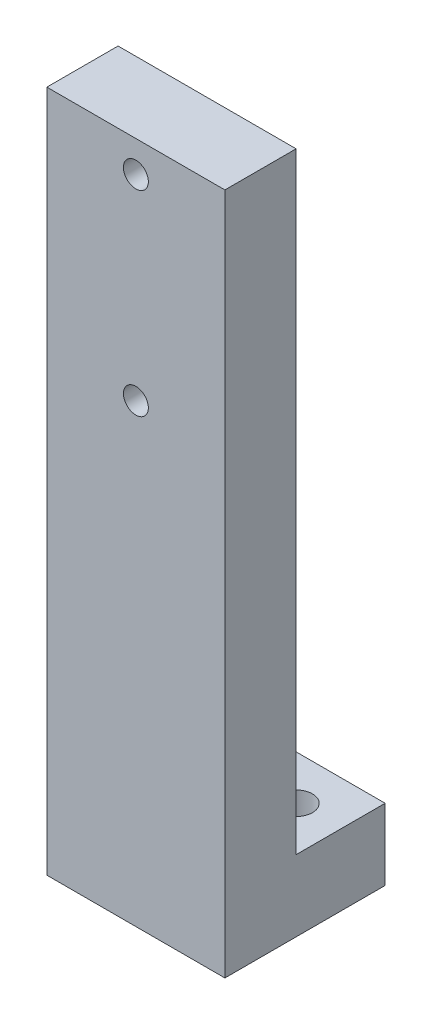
ISO-10303-21;
HEADER;
FILE_DESCRIPTION(('STEP AP214'),'2;1');
FILE_NAME('part.step','',(''),(''),'','','');
FILE_SCHEMA(('AUTOMOTIVE_DESIGN { 1 0 10303 214 1 1 1 1 }'));
ENDSEC;
DATA;
#1=APPLICATION_CONTEXT('core data for automotive mechanical design processes');
#2=APPLICATION_PROTOCOL_DEFINITION('international standard','automotive_design',2000,#1);
#3=PRODUCT_CONTEXT('',#1,'mechanical');
#4=PRODUCT('Part','Part','',(#3));
#5=PRODUCT_RELATED_PRODUCT_CATEGORY('part','',(#4));
#6=PRODUCT_DEFINITION_FORMATION('','',#4);
#7=PRODUCT_DEFINITION_CONTEXT('part definition',#1,'design');
#8=PRODUCT_DEFINITION('design','',#6,#7);
#9=PRODUCT_DEFINITION_SHAPE('','',#8);
#10=(LENGTH_UNIT() NAMED_UNIT(*) SI_UNIT(.MILLI.,.METRE.));
#11=(NAMED_UNIT(*) PLANE_ANGLE_UNIT() SI_UNIT($,.RADIAN.));
#12=(NAMED_UNIT(*) SI_UNIT($,.STERADIAN.) SOLID_ANGLE_UNIT());
#13=UNCERTAINTY_MEASURE_WITH_UNIT(LENGTH_MEASURE(1.E-05),#10,'distance_accuracy_value','');
#14=(GEOMETRIC_REPRESENTATION_CONTEXT(3) GLOBAL_UNCERTAINTY_ASSIGNED_CONTEXT((#13)) GLOBAL_UNIT_ASSIGNED_CONTEXT((#10,
#11,#12)) REPRESENTATION_CONTEXT('',''));
#15=CARTESIAN_POINT('',(0.,0.,0.));
#16=DIRECTION('',(0.,0.,1.));
#17=DIRECTION('',(1.,0.,0.));
#18=AXIS2_PLACEMENT_3D('',#15,#16,#17);
#19=CARTESIAN_POINT('',(30.,0.,0.));
#20=DIRECTION('',(0.,0.,1.));
#21=DIRECTION('',(1.,0.,0.));
#22=AXIS2_PLACEMENT_3D('',#19,#20,#21);
#23=PLANE('',#22);
#24=DIRECTION('',(-1.,0.,0.));
#25=VECTOR('',#24,1.);
#26=CARTESIAN_POINT('',(182.346233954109,12.,0.));
#27=LINE('',#26,#25);
#28=CARTESIAN_POINT('',(30.,12.,0.));
#29=VERTEX_POINT('',#28);
#30=CARTESIAN_POINT('',(0.,12.,0.));
#31=VERTEX_POINT('',#30);
#32=EDGE_CURVE('E55',#29,#31,#27,.T.);
#33=ORIENTED_EDGE('',*,*,#32,.F.);
#34=DIRECTION('',(0.,1.,0.));
#35=VECTOR('',#34,1.);
#36=CARTESIAN_POINT('',(30.,0.,0.));
#37=LINE('',#36,#35);
#38=CARTESIAN_POINT('',(30.,0.,0.));
#39=VERTEX_POINT('',#38);
#40=EDGE_CURVE('E136',#39,#29,#37,.T.);
#41=ORIENTED_EDGE('',*,*,#40,.F.);
#42=DIRECTION('',(1.,0.,0.));
#43=VECTOR('',#42,1.);
#44=CARTESIAN_POINT('',(0.,0.,0.));
#45=LINE('',#44,#43);
#46=CARTESIAN_POINT('',(0.,0.,0.));
#47=VERTEX_POINT('',#46);
#48=EDGE_CURVE('E122',#47,#39,#45,.T.);
#49=ORIENTED_EDGE('',*,*,#48,.F.);
#50=DIRECTION('',(0.,-1.,0.));
#51=VECTOR('',#50,1.);
#52=CARTESIAN_POINT('',(0.,0.,0.));
#53=LINE('',#52,#51);
#54=EDGE_CURVE('E127',#31,#47,#53,.T.);
#55=ORIENTED_EDGE('',*,*,#54,.F.);
#56=EDGE_LOOP('',(#33,#41,#49,#55));
#57=FACE_BOUND('',#56,.T.);
#58=ADVANCED_FACE('F32',(#57),#23,.F.);
#59=CARTESIAN_POINT('',(30.,0.,27.));
#60=DIRECTION('',(-1.,0.,0.));
#61=DIRECTION('',(0.,0.,1.));
#62=AXIS2_PLACEMENT_3D('',#59,#60,#61);
#63=PLANE('',#62);
#64=DIRECTION('',(0.,-1.,0.));
#65=VECTOR('',#64,1.);
#66=CARTESIAN_POINT('',(30.,0.,15.));
#67=LINE('',#66,#65);
#68=CARTESIAN_POINT('',(30.,115.,15.));
#69=VERTEX_POINT('',#68);
#70=CARTESIAN_POINT('',(30.,12.,15.));
#71=VERTEX_POINT('',#70);
#72=EDGE_CURVE('E94',#69,#71,#67,.T.);
#73=ORIENTED_EDGE('',*,*,#72,.F.);
#74=DIRECTION('',(0.,0.,-1.));
#75=VECTOR('',#74,1.);
#76=CARTESIAN_POINT('',(30.,115.,27.));
#77=LINE('',#76,#75);
#78=CARTESIAN_POINT('',(30.,115.,27.));
#79=VERTEX_POINT('',#78);
#80=EDGE_CURVE('E142',#79,#69,#77,.T.);
#81=ORIENTED_EDGE('',*,*,#80,.F.);
#82=DIRECTION('',(0.,1.,0.));
#83=VECTOR('',#82,1.);
#84=CARTESIAN_POINT('',(30.,0.,27.));
#85=LINE('',#84,#83);
#86=CARTESIAN_POINT('',(30.,0.,27.));
#87=VERTEX_POINT('',#86);
#88=EDGE_CURVE('E126',#87,#79,#85,.T.);
#89=ORIENTED_EDGE('',*,*,#88,.F.);
#90=DIRECTION('',(0.,0.,-1.));
#91=VECTOR('',#90,1.);
#92=CARTESIAN_POINT('',(30.,0.,27.));
#93=LINE('',#92,#91);
#94=EDGE_CURVE('E40',#87,#39,#93,.T.);
#95=ORIENTED_EDGE('',*,*,#94,.T.);
#96=ORIENTED_EDGE('',*,*,#40,.T.);
#97=DIRECTION('',(0.,0.,-1.));
#98=VECTOR('',#97,1.);
#99=CARTESIAN_POINT('',(30.,12.,27.));
#100=LINE('',#99,#98);
#101=EDGE_CURVE('E47',#71,#29,#100,.T.);
#102=ORIENTED_EDGE('',*,*,#101,.F.);
#103=EDGE_LOOP('',(#73,#81,#89,#95,#96,#102));
#104=FACE_BOUND('',#103,.T.);
#105=ADVANCED_FACE('F153',(#104),#63,.F.);
#106=CARTESIAN_POINT('',(0.,115.,27.));
#107=DIRECTION('',(0.,-1.,0.));
#108=DIRECTION('',(0.,0.,-1.));
#109=AXIS2_PLACEMENT_3D('',#106,#107,#108);
#110=PLANE('',#109);
#111=DIRECTION('',(-1.,0.,0.));
#112=VECTOR('',#111,1.);
#113=CARTESIAN_POINT('',(182.346233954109,115.,15.));
#114=LINE('',#113,#112);
#115=CARTESIAN_POINT('',(0.,115.,15.));
#116=VERTEX_POINT('',#115);
#117=EDGE_CURVE('E104',#69,#116,#114,.T.);
#118=ORIENTED_EDGE('',*,*,#117,.T.);
#119=DIRECTION('',(0.,0.,-1.));
#120=VECTOR('',#119,1.);
#121=CARTESIAN_POINT('',(0.,115.,27.));
#122=LINE('',#121,#120);
#123=CARTESIAN_POINT('',(0.,115.,27.));
#124=VERTEX_POINT('',#123);
#125=EDGE_CURVE('E90',#124,#116,#122,.T.);
#126=ORIENTED_EDGE('',*,*,#125,.F.);
#127=DIRECTION('',(-1.,0.,0.));
#128=VECTOR('',#127,1.);
#129=CARTESIAN_POINT('',(0.,115.,27.));
#130=LINE('',#129,#128);
#131=EDGE_CURVE('E129',#79,#124,#130,.T.);
#132=ORIENTED_EDGE('',*,*,#131,.F.);
#133=ORIENTED_EDGE('',*,*,#80,.T.);
#134=EDGE_LOOP('',(#118,#126,#132,#133));
#135=FACE_BOUND('',#134,.T.);
#136=ADVANCED_FACE('F150',(#135),#110,.F.);
#137=CARTESIAN_POINT('',(0.,0.,27.));
#138=DIRECTION('',(1.,0.,0.));
#139=DIRECTION('',(0.,0.,-1.));
#140=AXIS2_PLACEMENT_3D('',#137,#138,#139);
#141=PLANE('',#140);
#142=DIRECTION('',(0.,1.,0.));
#143=VECTOR('',#142,1.);
#144=CARTESIAN_POINT('',(0.,0.,15.));
#145=LINE('',#144,#143);
#146=CARTESIAN_POINT('',(0.,12.,15.));
#147=VERTEX_POINT('',#146);
#148=EDGE_CURVE('E86',#147,#116,#145,.T.);
#149=ORIENTED_EDGE('',*,*,#148,.F.);
#150=DIRECTION('',(0.,0.,1.));
#151=VECTOR('',#150,1.);
#152=CARTESIAN_POINT('',(0.,12.,27.));
#153=LINE('',#152,#151);
#154=EDGE_CURVE('E11',#31,#147,#153,.T.);
#155=ORIENTED_EDGE('',*,*,#154,.F.);
#156=ORIENTED_EDGE('',*,*,#54,.T.);
#157=DIRECTION('',(0.,0.,-1.));
#158=VECTOR('',#157,1.);
#159=CARTESIAN_POINT('',(0.,0.,27.));
#160=LINE('',#159,#158);
#161=CARTESIAN_POINT('',(0.,0.,27.));
#162=VERTEX_POINT('',#161);
#163=EDGE_CURVE('E133',#162,#47,#160,.T.);
#164=ORIENTED_EDGE('',*,*,#163,.F.);
#165=DIRECTION('',(0.,-1.,0.));
#166=VECTOR('',#165,1.);
#167=CARTESIAN_POINT('',(0.,0.,27.));
#168=LINE('',#167,#166);
#169=EDGE_CURVE('E131',#124,#162,#168,.T.);
#170=ORIENTED_EDGE('',*,*,#169,.F.);
#171=ORIENTED_EDGE('',*,*,#125,.T.);
#172=EDGE_LOOP('',(#149,#155,#156,#164,#170,#171));
#173=FACE_BOUND('',#172,.T.);
#174=ADVANCED_FACE('F87',(#173),#141,.F.);
#175=CARTESIAN_POINT('',(15.,109.74,27.));
#176=DIRECTION('',(0.,0.,-1.));
#177=DIRECTION('',(-1.,0.,0.));
#178=AXIS2_PLACEMENT_3D('',#175,#176,#177);
#179=CYLINDRICAL_SURFACE('',#178,2.1);
#180=CARTESIAN_POINT('',(15.,109.74,27.));
#181=DIRECTION('',(0.,0.,1.));
#182=DIRECTION('',(1.,0.,0.));
#183=AXIS2_PLACEMENT_3D('',#180,#181,#182);
#184=CIRCLE('',#183,2.1);
#185=CARTESIAN_POINT('',(17.1,109.74,27.));
#186=VERTEX_POINT('',#185);
#187=EDGE_CURVE('E119',#186,#186,#184,.T.);
#188=ORIENTED_EDGE('',*,*,#187,.T.);
#189=EDGE_LOOP('',(#188));
#190=FACE_BOUND('',#189,.T.);
#191=CARTESIAN_POINT('',(15.,109.74,15.));
#192=DIRECTION('',(0.,0.,-1.));
#193=DIRECTION('',(-1.,0.,0.));
#194=AXIS2_PLACEMENT_3D('',#191,#192,#193);
#195=CIRCLE('',#194,2.1);
#196=CARTESIAN_POINT('',(12.9,109.74,15.));
#197=VERTEX_POINT('',#196);
#198=EDGE_CURVE('E95',#197,#197,#195,.T.);
#199=ORIENTED_EDGE('',*,*,#198,.T.);
#200=EDGE_LOOP('',(#199));
#201=FACE_BOUND('',#200,.T.);
#202=ADVANCED_FACE('F172',(#190,#201),#179,.F.);
#203=CARTESIAN_POINT('',(15.,76.7400000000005,27.));
#204=DIRECTION('',(0.,0.,-1.));
#205=DIRECTION('',(-1.,0.,0.));
#206=AXIS2_PLACEMENT_3D('',#203,#204,#205);
#207=CYLINDRICAL_SURFACE('',#206,2.1);
#208=CARTESIAN_POINT('',(15.,76.7400000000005,27.));
#209=DIRECTION('',(0.,0.,1.));
#210=DIRECTION('',(1.,0.,0.));
#211=AXIS2_PLACEMENT_3D('',#208,#209,#210);
#212=CIRCLE('',#211,2.1);
#213=CARTESIAN_POINT('',(17.1,76.7400000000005,27.));
#214=VERTEX_POINT('',#213);
#215=EDGE_CURVE('E116',#214,#214,#212,.T.);
#216=ORIENTED_EDGE('',*,*,#215,.T.);
#217=EDGE_LOOP('',(#216));
#218=FACE_BOUND('',#217,.T.);
#219=CARTESIAN_POINT('',(15.,76.7400000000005,15.));
#220=DIRECTION('',(0.,0.,-1.));
#221=DIRECTION('',(-1.,0.,0.));
#222=AXIS2_PLACEMENT_3D('',#219,#220,#221);
#223=CIRCLE('',#222,2.1);
#224=CARTESIAN_POINT('',(12.9,76.7400000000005,15.));
#225=VERTEX_POINT('',#224);
#226=EDGE_CURVE('E112',#225,#225,#223,.T.);
#227=ORIENTED_EDGE('',*,*,#226,.T.);
#228=EDGE_LOOP('',(#227));
#229=FACE_BOUND('',#228,.T.);
#230=ADVANCED_FACE('F188',(#218,#229),#207,.F.);
#231=CARTESIAN_POINT('',(30.,0.,27.));
#232=DIRECTION('',(0.,0.,1.));
#233=DIRECTION('',(1.,0.,0.));
#234=AXIS2_PLACEMENT_3D('',#231,#232,#233);
#235=PLANE('',#234);
#236=ORIENTED_EDGE('',*,*,#187,.F.);
#237=EDGE_LOOP('',(#236));
#238=FACE_BOUND('',#237,.T.);
#239=DIRECTION('',(1.,0.,0.));
#240=VECTOR('',#239,1.);
#241=CARTESIAN_POINT('',(0.,0.,27.));
#242=LINE('',#241,#240);
#243=EDGE_CURVE('E123',#162,#87,#242,.T.);
#244=ORIENTED_EDGE('',*,*,#243,.T.);
#245=ORIENTED_EDGE('',*,*,#88,.T.);
#246=ORIENTED_EDGE('',*,*,#131,.T.);
#247=ORIENTED_EDGE('',*,*,#169,.T.);
#248=EDGE_LOOP('',(#244,#245,#246,#247));
#249=FACE_BOUND('',#248,.T.);
#250=ORIENTED_EDGE('',*,*,#215,.F.);
#251=EDGE_LOOP('',(#250));
#252=FACE_BOUND('',#251,.T.);
#253=ADVANCED_FACE('F157',(#238,#249,#252),#235,.T.);
#254=CARTESIAN_POINT('',(0.,0.,27.));
#255=DIRECTION('',(0.,1.,0.));
#256=DIRECTION('',(0.,0.,1.));
#257=AXIS2_PLACEMENT_3D('',#254,#255,#256);
#258=PLANE('',#257);
#259=CARTESIAN_POINT('',(22.5,0.,7.5));
#260=DIRECTION('',(0.,1.,0.));
#261=DIRECTION('',(0.,0.,1.));
#262=AXIS2_PLACEMENT_3D('',#259,#260,#261);
#263=CIRCLE('',#262,2.75);
#264=CARTESIAN_POINT('',(22.5,0.,10.25));
#265=VERTEX_POINT('',#264);
#266=EDGE_CURVE('E274',#265,#265,#263,.T.);
#267=ORIENTED_EDGE('',*,*,#266,.T.);
#268=EDGE_LOOP('',(#267));
#269=FACE_BOUND('',#268,.T.);
#270=CARTESIAN_POINT('',(7.5,0.,7.5));
#271=DIRECTION('',(0.,1.,0.));
#272=DIRECTION('',(0.,0.,1.));
#273=AXIS2_PLACEMENT_3D('',#270,#271,#272);
#274=CIRCLE('',#273,2.75);
#275=CARTESIAN_POINT('',(7.5,0.,10.25));
#276=VERTEX_POINT('',#275);
#277=EDGE_CURVE('E102',#276,#276,#274,.T.);
#278=ORIENTED_EDGE('',*,*,#277,.T.);
#279=EDGE_LOOP('',(#278));
#280=FACE_BOUND('',#279,.T.);
#281=ORIENTED_EDGE('',*,*,#48,.T.);
#282=ORIENTED_EDGE('',*,*,#94,.F.);
#283=ORIENTED_EDGE('',*,*,#243,.F.);
#284=ORIENTED_EDGE('',*,*,#163,.T.);
#285=EDGE_LOOP('',(#281,#282,#283,#284));
#286=FACE_BOUND('',#285,.T.);
#287=ADVANCED_FACE('F34',(#269,#280,#286),#258,.F.);
#288=CARTESIAN_POINT('',(182.346233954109,12.,15.));
#289=DIRECTION('',(0.,1.,0.));
#290=DIRECTION('',(0.,0.,1.));
#291=AXIS2_PLACEMENT_3D('',#288,#289,#290);
#292=PLANE('',#291);
#293=CARTESIAN_POINT('',(22.5,12.,7.5));
#294=DIRECTION('',(0.,1.,0.));
#295=DIRECTION('',(0.,0.,1.));
#296=AXIS2_PLACEMENT_3D('',#293,#294,#295);
#297=CIRCLE('',#296,2.75);
#298=CARTESIAN_POINT('',(22.5,12.,10.25));
#299=VERTEX_POINT('',#298);
#300=EDGE_CURVE('E271',#299,#299,#297,.T.);
#301=ORIENTED_EDGE('',*,*,#300,.F.);
#302=EDGE_LOOP('',(#301));
#303=FACE_BOUND('',#302,.T.);
#304=CARTESIAN_POINT('',(7.5,12.,7.5));
#305=DIRECTION('',(0.,1.,0.));
#306=DIRECTION('',(0.,0.,1.));
#307=AXIS2_PLACEMENT_3D('',#304,#305,#306);
#308=CIRCLE('',#307,2.75);
#309=CARTESIAN_POINT('',(7.5,12.,10.25));
#310=VERTEX_POINT('',#309);
#311=EDGE_CURVE('E107',#310,#310,#308,.T.);
#312=ORIENTED_EDGE('',*,*,#311,.F.);
#313=EDGE_LOOP('',(#312));
#314=FACE_BOUND('',#313,.T.);
#315=DIRECTION('',(-1.,0.,0.));
#316=VECTOR('',#315,1.);
#317=CARTESIAN_POINT('',(182.346233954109,12.,15.));
#318=LINE('',#317,#316);
#319=EDGE_CURVE('E100',#71,#147,#318,.T.);
#320=ORIENTED_EDGE('',*,*,#319,.F.);
#321=ORIENTED_EDGE('',*,*,#101,.T.);
#322=ORIENTED_EDGE('',*,*,#32,.T.);
#323=ORIENTED_EDGE('',*,*,#154,.T.);
#324=EDGE_LOOP('',(#320,#321,#322,#323));
#325=FACE_BOUND('',#324,.T.);
#326=ADVANCED_FACE('F99',(#303,#314,#325),#292,.T.);
#327=CARTESIAN_POINT('',(182.346233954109,12.,15.));
#328=DIRECTION('',(0.,0.,-1.));
#329=DIRECTION('',(-1.,0.,0.));
#330=AXIS2_PLACEMENT_3D('',#327,#328,#329);
#331=PLANE('',#330);
#332=ORIENTED_EDGE('',*,*,#198,.F.);
#333=EDGE_LOOP('',(#332));
#334=FACE_BOUND('',#333,.T.);
#335=ORIENTED_EDGE('',*,*,#226,.F.);
#336=EDGE_LOOP('',(#335));
#337=FACE_BOUND('',#336,.T.);
#338=ORIENTED_EDGE('',*,*,#117,.F.);
#339=ORIENTED_EDGE('',*,*,#72,.T.);
#340=ORIENTED_EDGE('',*,*,#319,.T.);
#341=ORIENTED_EDGE('',*,*,#148,.T.);
#342=EDGE_LOOP('',(#338,#339,#340,#341));
#343=FACE_BOUND('',#342,.T.);
#344=ADVANCED_FACE('F101',(#334,#337,#343),#331,.T.);
#345=CARTESIAN_POINT('',(7.5,-15.,7.5));
#346=DIRECTION('',(0.,1.,0.));
#347=DIRECTION('',(0.,0.,1.));
#348=AXIS2_PLACEMENT_3D('',#345,#346,#347);
#349=CYLINDRICAL_SURFACE('',#348,2.75);
#350=ORIENTED_EDGE('',*,*,#311,.T.);
#351=EDGE_LOOP('',(#350));
#352=FACE_BOUND('',#351,.T.);
#353=ORIENTED_EDGE('',*,*,#277,.F.);
#354=EDGE_LOOP('',(#353));
#355=FACE_BOUND('',#354,.T.);
#356=ADVANCED_FACE('F222',(#352,#355),#349,.F.);
#357=CARTESIAN_POINT('',(22.5,-15.,7.5));
#358=DIRECTION('',(0.,1.,0.));
#359=DIRECTION('',(0.,0.,1.));
#360=AXIS2_PLACEMENT_3D('',#357,#358,#359);
#361=CYLINDRICAL_SURFACE('',#360,2.75);
#362=ORIENTED_EDGE('',*,*,#300,.T.);
#363=EDGE_LOOP('',(#362));
#364=FACE_BOUND('',#363,.T.);
#365=ORIENTED_EDGE('',*,*,#266,.F.);
#366=EDGE_LOOP('',(#365));
#367=FACE_BOUND('',#366,.T.);
#368=ADVANCED_FACE('F229',(#364,#367),#361,.F.);
#369=CLOSED_SHELL('',(#58,#105,#136,#174,#202,#230,#253,#287,#326,#344,#356,#368));
#370=MANIFOLD_SOLID_BREP('B2',#369);
#371=ADVANCED_BREP_SHAPE_REPRESENTATION('',(#18,#370),#14);
#372=SHAPE_DEFINITION_REPRESENTATION(#9,#371);
ENDSEC;
END-ISO-10303-21;
